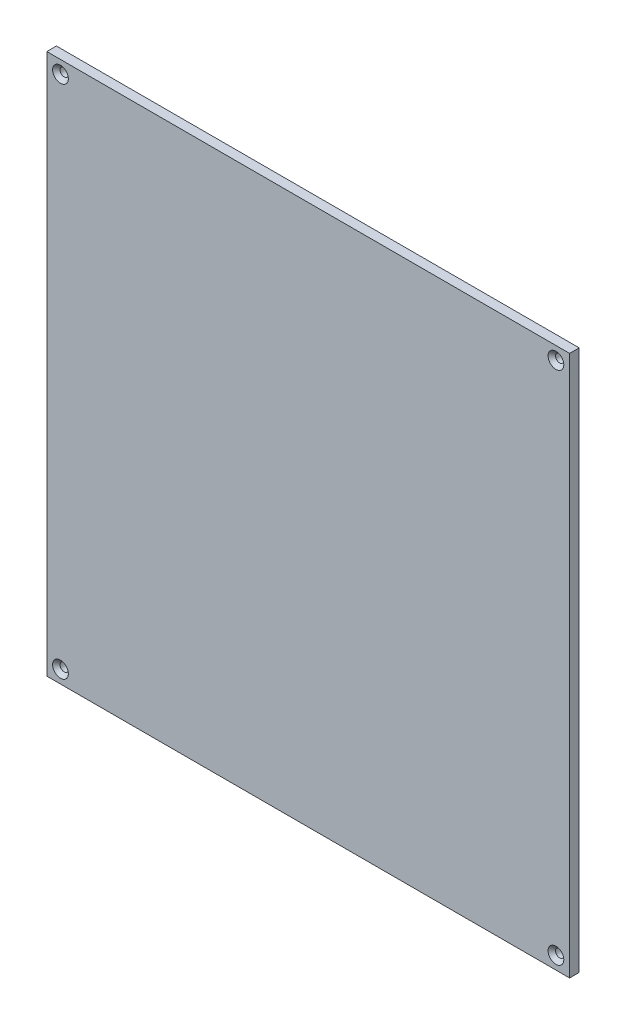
ISO-10303-21;
HEADER;
FILE_DESCRIPTION(('STEP AP214'),'2;1');
FILE_NAME('part.step','',(''),(''),'','','');
FILE_SCHEMA(('AUTOMOTIVE_DESIGN { 1 0 10303 214 1 1 1 1 }'));
ENDSEC;
DATA;
#1=APPLICATION_CONTEXT('core data for automotive mechanical design processes');
#2=APPLICATION_PROTOCOL_DEFINITION('international standard','automotive_design',2000,#1);
#3=PRODUCT_CONTEXT('',#1,'mechanical');
#4=PRODUCT('Part','Part','',(#3));
#5=PRODUCT_RELATED_PRODUCT_CATEGORY('part','',(#4));
#6=PRODUCT_DEFINITION_FORMATION('','',#4);
#7=PRODUCT_DEFINITION_CONTEXT('part definition',#1,'design');
#8=PRODUCT_DEFINITION('design','',#6,#7);
#9=PRODUCT_DEFINITION_SHAPE('','',#8);
#10=(LENGTH_UNIT() NAMED_UNIT(*) SI_UNIT(.MILLI.,.METRE.));
#11=(NAMED_UNIT(*) PLANE_ANGLE_UNIT() SI_UNIT($,.RADIAN.));
#12=(NAMED_UNIT(*) SI_UNIT($,.STERADIAN.) SOLID_ANGLE_UNIT());
#13=UNCERTAINTY_MEASURE_WITH_UNIT(LENGTH_MEASURE(1.E-05),#10,'distance_accuracy_value','');
#14=(GEOMETRIC_REPRESENTATION_CONTEXT(3) GLOBAL_UNCERTAINTY_ASSIGNED_CONTEXT((#13)) GLOBAL_UNIT_ASSIGNED_CONTEXT((#10,
#11,#12)) REPRESENTATION_CONTEXT('',''));
#15=CARTESIAN_POINT('',(0.,0.,0.));
#16=DIRECTION('',(0.,0.,1.));
#17=DIRECTION('',(1.,0.,0.));
#18=AXIS2_PLACEMENT_3D('',#15,#16,#17);
#19=CARTESIAN_POINT('',(173.,0.,6.35));
#20=DIRECTION('',(1.,0.,0.));
#21=DIRECTION('',(0.,0.,-1.));
#22=AXIS2_PLACEMENT_3D('',#19,#20,#21);
#23=PLANE('',#22);
#24=DIRECTION('',(0.,-1.,0.));
#25=VECTOR('',#24,1.);
#26=CARTESIAN_POINT('',(173.,0.,0.));
#27=LINE('',#26,#25);
#28=CARTESIAN_POINT('',(173.,179.,0.));
#29=VERTEX_POINT('',#28);
#30=CARTESIAN_POINT('',(173.,-179.,0.));
#31=VERTEX_POINT('',#30);
#32=EDGE_CURVE('E101',#29,#31,#27,.T.);
#33=ORIENTED_EDGE('',*,*,#32,.F.);
#34=DIRECTION('',(0.,0.,-1.));
#35=VECTOR('',#34,1.);
#36=CARTESIAN_POINT('',(173.,179.,6.35));
#37=LINE('',#36,#35);
#38=CARTESIAN_POINT('',(173.,179.,6.35));
#39=VERTEX_POINT('',#38);
#40=EDGE_CURVE('E11',#39,#29,#37,.T.);
#41=ORIENTED_EDGE('',*,*,#40,.F.);
#42=DIRECTION('',(0.,-1.,0.));
#43=VECTOR('',#42,1.);
#44=CARTESIAN_POINT('',(173.,0.,6.35));
#45=LINE('',#44,#43);
#46=CARTESIAN_POINT('',(173.,-179.,6.35));
#47=VERTEX_POINT('',#46);
#48=EDGE_CURVE('E94',#39,#47,#45,.T.);
#49=ORIENTED_EDGE('',*,*,#48,.T.);
#50=DIRECTION('',(0.,0.,-1.));
#51=VECTOR('',#50,1.);
#52=CARTESIAN_POINT('',(173.,-179.,6.35));
#53=LINE('',#52,#51);
#54=EDGE_CURVE('E76',#47,#31,#53,.T.);
#55=ORIENTED_EDGE('',*,*,#54,.T.);
#56=EDGE_LOOP('',(#33,#41,#49,#55));
#57=FACE_BOUND('',#56,.T.);
#58=ADVANCED_FACE('F38',(#57),#23,.T.);
#59=CARTESIAN_POINT('',(0.,179.,6.35));
#60=DIRECTION('',(0.,1.,0.));
#61=DIRECTION('',(0.,0.,1.));
#62=AXIS2_PLACEMENT_3D('',#59,#60,#61);
#63=PLANE('',#62);
#64=DIRECTION('',(1.,0.,0.));
#65=VECTOR('',#64,1.);
#66=CARTESIAN_POINT('',(0.,179.,0.));
#67=LINE('',#66,#65);
#68=CARTESIAN_POINT('',(-173.,179.,0.));
#69=VERTEX_POINT('',#68);
#70=EDGE_CURVE('E87',#69,#29,#67,.T.);
#71=ORIENTED_EDGE('',*,*,#70,.F.);
#72=DIRECTION('',(0.,0.,-1.));
#73=VECTOR('',#72,1.);
#74=CARTESIAN_POINT('',(-173.,179.,6.35));
#75=LINE('',#74,#73);
#76=CARTESIAN_POINT('',(-173.,179.,6.35));
#77=VERTEX_POINT('',#76);
#78=EDGE_CURVE('E46',#77,#69,#75,.T.);
#79=ORIENTED_EDGE('',*,*,#78,.F.);
#80=DIRECTION('',(1.,0.,0.));
#81=VECTOR('',#80,1.);
#82=CARTESIAN_POINT('',(0.,179.,6.35));
#83=LINE('',#82,#81);
#84=EDGE_CURVE('E85',#77,#39,#83,.T.);
#85=ORIENTED_EDGE('',*,*,#84,.T.);
#86=ORIENTED_EDGE('',*,*,#40,.T.);
#87=EDGE_LOOP('',(#71,#79,#85,#86));
#88=FACE_BOUND('',#87,.T.);
#89=ADVANCED_FACE('F84',(#88),#63,.T.);
#90=CARTESIAN_POINT('',(-173.,0.,6.35));
#91=DIRECTION('',(-1.,0.,0.));
#92=DIRECTION('',(0.,0.,1.));
#93=AXIS2_PLACEMENT_3D('',#90,#91,#92);
#94=PLANE('',#93);
#95=DIRECTION('',(0.,1.,0.));
#96=VECTOR('',#95,1.);
#97=CARTESIAN_POINT('',(-173.,0.,0.));
#98=LINE('',#97,#96);
#99=CARTESIAN_POINT('',(-173.,-179.,0.));
#100=VERTEX_POINT('',#99);
#101=EDGE_CURVE('E106',#100,#69,#98,.T.);
#102=ORIENTED_EDGE('',*,*,#101,.F.);
#103=DIRECTION('',(0.,0.,-1.));
#104=VECTOR('',#103,1.);
#105=CARTESIAN_POINT('',(-173.,-179.,6.35));
#106=LINE('',#105,#104);
#107=CARTESIAN_POINT('',(-173.,-179.,6.35));
#108=VERTEX_POINT('',#107);
#109=EDGE_CURVE('E69',#108,#100,#106,.T.);
#110=ORIENTED_EDGE('',*,*,#109,.F.);
#111=DIRECTION('',(0.,1.,0.));
#112=VECTOR('',#111,1.);
#113=CARTESIAN_POINT('',(-173.,0.,6.35));
#114=LINE('',#113,#112);
#115=EDGE_CURVE('E93',#108,#77,#114,.T.);
#116=ORIENTED_EDGE('',*,*,#115,.T.);
#117=ORIENTED_EDGE('',*,*,#78,.T.);
#118=EDGE_LOOP('',(#102,#110,#116,#117));
#119=FACE_BOUND('',#118,.T.);
#120=ADVANCED_FACE('F96',(#119),#94,.T.);
#121=CARTESIAN_POINT('',(0.,-179.,6.35));
#122=DIRECTION('',(0.,1.,0.));
#123=DIRECTION('',(0.,0.,1.));
#124=AXIS2_PLACEMENT_3D('',#121,#122,#123);
#125=PLANE('',#124);
#126=DIRECTION('',(1.,0.,0.));
#127=VECTOR('',#126,1.);
#128=CARTESIAN_POINT('',(0.,-179.,0.));
#129=LINE('',#128,#127);
#130=EDGE_CURVE('E108',#100,#31,#129,.T.);
#131=ORIENTED_EDGE('',*,*,#130,.T.);
#132=ORIENTED_EDGE('',*,*,#54,.F.);
#133=DIRECTION('',(1.,0.,0.));
#134=VECTOR('',#133,1.);
#135=CARTESIAN_POINT('',(0.,-179.,6.35));
#136=LINE('',#135,#134);
#137=EDGE_CURVE('E54',#108,#47,#136,.T.);
#138=ORIENTED_EDGE('',*,*,#137,.F.);
#139=ORIENTED_EDGE('',*,*,#109,.T.);
#140=EDGE_LOOP('',(#131,#132,#138,#139));
#141=FACE_BOUND('',#140,.T.);
#142=ADVANCED_FACE('F153',(#141),#125,.F.);
#143=CARTESIAN_POINT('',(0.,0.,6.35));
#144=DIRECTION('',(0.,0.,1.));
#145=DIRECTION('',(1.,0.,0.));
#146=AXIS2_PLACEMENT_3D('',#143,#144,#145);
#147=PLANE('',#146);
#148=CARTESIAN_POINT('',(-163.95,170.5,6.35));
#149=DIRECTION('',(0.,0.,1.));
#150=DIRECTION('',(1.,0.,0.));
#151=AXIS2_PLACEMENT_3D('',#148,#149,#150);
#152=CIRCLE('',#151,5.20000000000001);
#153=CARTESIAN_POINT('',(-158.75,170.5,6.35));
#154=VERTEX_POINT('',#153);
#155=EDGE_CURVE('E144',#154,#154,#152,.T.);
#156=ORIENTED_EDGE('',*,*,#155,.F.);
#157=EDGE_LOOP('',(#156));
#158=FACE_BOUND('',#157,.T.);
#159=CARTESIAN_POINT('',(163.95,170.5,6.35));
#160=DIRECTION('',(0.,0.,1.));
#161=DIRECTION('',(1.,0.,0.));
#162=AXIS2_PLACEMENT_3D('',#159,#160,#161);
#163=CIRCLE('',#162,5.20000000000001);
#164=CARTESIAN_POINT('',(169.15,170.5,6.35));
#165=VERTEX_POINT('',#164);
#166=EDGE_CURVE('E135',#165,#165,#163,.T.);
#167=ORIENTED_EDGE('',*,*,#166,.F.);
#168=EDGE_LOOP('',(#167));
#169=FACE_BOUND('',#168,.T.);
#170=CARTESIAN_POINT('',(163.95,-170.5,6.35));
#171=DIRECTION('',(0.,0.,1.));
#172=DIRECTION('',(1.,0.,0.));
#173=AXIS2_PLACEMENT_3D('',#170,#171,#172);
#174=CIRCLE('',#173,5.20000000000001);
#175=CARTESIAN_POINT('',(169.15,-170.5,6.35));
#176=VERTEX_POINT('',#175);
#177=EDGE_CURVE('E126',#176,#176,#174,.T.);
#178=ORIENTED_EDGE('',*,*,#177,.F.);
#179=EDGE_LOOP('',(#178));
#180=FACE_BOUND('',#179,.T.);
#181=CARTESIAN_POINT('',(-163.95,-170.5,6.35));
#182=DIRECTION('',(0.,0.,1.));
#183=DIRECTION('',(1.,0.,0.));
#184=AXIS2_PLACEMENT_3D('',#181,#182,#183);
#185=CIRCLE('',#184,5.20000000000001);
#186=CARTESIAN_POINT('',(-158.75,-170.5,6.35));
#187=VERTEX_POINT('',#186);
#188=EDGE_CURVE('E117',#187,#187,#185,.T.);
#189=ORIENTED_EDGE('',*,*,#188,.F.);
#190=EDGE_LOOP('',(#189));
#191=FACE_BOUND('',#190,.T.);
#192=ORIENTED_EDGE('',*,*,#48,.F.);
#193=ORIENTED_EDGE('',*,*,#84,.F.);
#194=ORIENTED_EDGE('',*,*,#115,.F.);
#195=ORIENTED_EDGE('',*,*,#137,.T.);
#196=EDGE_LOOP('',(#192,#193,#194,#195));
#197=FACE_BOUND('',#196,.T.);
#198=ADVANCED_FACE('F92',(#158,#169,#180,#191,#197),#147,.T.);
#199=CARTESIAN_POINT('',(0.,0.,0.));
#200=DIRECTION('',(0.,0.,1.));
#201=DIRECTION('',(1.,0.,0.));
#202=AXIS2_PLACEMENT_3D('',#199,#200,#201);
#203=PLANE('',#202);
#204=CARTESIAN_POINT('',(-163.95,170.5,0.));
#205=DIRECTION('',(0.,0.,1.));
#206=DIRECTION('',(1.,0.,0.));
#207=AXIS2_PLACEMENT_3D('',#204,#205,#206);
#208=CIRCLE('',#207,2.74999999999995);
#209=CARTESIAN_POINT('',(-161.2,170.5,0.));
#210=VERTEX_POINT('',#209);
#211=EDGE_CURVE('E138',#210,#210,#208,.T.);
#212=ORIENTED_EDGE('',*,*,#211,.T.);
#213=EDGE_LOOP('',(#212));
#214=FACE_BOUND('',#213,.T.);
#215=CARTESIAN_POINT('',(163.95,170.5,0.));
#216=DIRECTION('',(0.,0.,1.));
#217=DIRECTION('',(1.,0.,0.));
#218=AXIS2_PLACEMENT_3D('',#215,#216,#217);
#219=CIRCLE('',#218,2.74999999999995);
#220=CARTESIAN_POINT('',(166.7,170.5,0.));
#221=VERTEX_POINT('',#220);
#222=EDGE_CURVE('E129',#221,#221,#219,.T.);
#223=ORIENTED_EDGE('',*,*,#222,.T.);
#224=EDGE_LOOP('',(#223));
#225=FACE_BOUND('',#224,.T.);
#226=CARTESIAN_POINT('',(163.95,-170.5,0.));
#227=DIRECTION('',(0.,0.,1.));
#228=DIRECTION('',(1.,0.,0.));
#229=AXIS2_PLACEMENT_3D('',#226,#227,#228);
#230=CIRCLE('',#229,2.74999999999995);
#231=CARTESIAN_POINT('',(166.7,-170.5,0.));
#232=VERTEX_POINT('',#231);
#233=EDGE_CURVE('E120',#232,#232,#230,.T.);
#234=ORIENTED_EDGE('',*,*,#233,.T.);
#235=EDGE_LOOP('',(#234));
#236=FACE_BOUND('',#235,.T.);
#237=CARTESIAN_POINT('',(-163.95,-170.5,0.));
#238=DIRECTION('',(0.,0.,1.));
#239=DIRECTION('',(1.,0.,0.));
#240=AXIS2_PLACEMENT_3D('',#237,#238,#239);
#241=CIRCLE('',#240,2.74999999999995);
#242=CARTESIAN_POINT('',(-161.2,-170.5,0.));
#243=VERTEX_POINT('',#242);
#244=EDGE_CURVE('E104',#243,#243,#241,.T.);
#245=ORIENTED_EDGE('',*,*,#244,.T.);
#246=EDGE_LOOP('',(#245));
#247=FACE_BOUND('',#246,.T.);
#248=ORIENTED_EDGE('',*,*,#32,.T.);
#249=ORIENTED_EDGE('',*,*,#130,.F.);
#250=ORIENTED_EDGE('',*,*,#101,.T.);
#251=ORIENTED_EDGE('',*,*,#70,.T.);
#252=EDGE_LOOP('',(#248,#249,#250,#251));
#253=FACE_BOUND('',#252,.T.);
#254=ADVANCED_FACE('F152',(#214,#225,#236,#247,#253),#203,.F.);
#255=CARTESIAN_POINT('',(-163.95,-170.5,6.35));
#256=DIRECTION('',(0.,0.,1.));
#257=DIRECTION('',(1.,0.,0.));
#258=AXIS2_PLACEMENT_3D('',#255,#256,#257);
#259=CYLINDRICAL_SURFACE('',#258,2.74999999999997);
#260=ORIENTED_EDGE('',*,*,#244,.F.);
#261=EDGE_LOOP('',(#260));
#262=FACE_BOUND('',#261,.T.);
#263=CARTESIAN_POINT('',(-163.95,-170.5,3.9));
#264=DIRECTION('',(0.,0.,1.));
#265=DIRECTION('',(1.,0.,0.));
#266=AXIS2_PLACEMENT_3D('',#263,#264,#265);
#267=CIRCLE('',#266,2.75);
#268=CARTESIAN_POINT('',(-161.2,-170.5,3.9));
#269=VERTEX_POINT('',#268);
#270=EDGE_CURVE('E114',#269,#269,#267,.T.);
#271=ORIENTED_EDGE('',*,*,#270,.T.);
#272=EDGE_LOOP('',(#271));
#273=FACE_BOUND('',#272,.T.);
#274=ADVANCED_FACE('F164',(#262,#273),#259,.F.);
#275=CARTESIAN_POINT('',(-163.95,-170.5,6.35));
#276=DIRECTION('',(0.,0.,1.));
#277=DIRECTION('',(1.,0.,0.));
#278=AXIS2_PLACEMENT_3D('',#275,#276,#277);
#279=CONICAL_SURFACE('',#278,5.20000000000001,0.78539816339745);
#280=ORIENTED_EDGE('',*,*,#270,.F.);
#281=EDGE_LOOP('',(#280));
#282=FACE_BOUND('',#281,.T.);
#283=ORIENTED_EDGE('',*,*,#188,.T.);
#284=EDGE_LOOP('',(#283));
#285=FACE_BOUND('',#284,.T.);
#286=ADVANCED_FACE('F161',(#282,#285),#279,.F.);
#287=CARTESIAN_POINT('',(163.95,-170.5,6.35));
#288=DIRECTION('',(0.,0.,1.));
#289=DIRECTION('',(1.,0.,0.));
#290=AXIS2_PLACEMENT_3D('',#287,#288,#289);
#291=CYLINDRICAL_SURFACE('',#290,2.74999999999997);
#292=ORIENTED_EDGE('',*,*,#233,.F.);
#293=EDGE_LOOP('',(#292));
#294=FACE_BOUND('',#293,.T.);
#295=CARTESIAN_POINT('',(163.95,-170.5,3.9));
#296=DIRECTION('',(0.,0.,1.));
#297=DIRECTION('',(1.,0.,0.));
#298=AXIS2_PLACEMENT_3D('',#295,#296,#297);
#299=CIRCLE('',#298,2.75);
#300=CARTESIAN_POINT('',(166.7,-170.5,3.9));
#301=VERTEX_POINT('',#300);
#302=EDGE_CURVE('E123',#301,#301,#299,.T.);
#303=ORIENTED_EDGE('',*,*,#302,.T.);
#304=EDGE_LOOP('',(#303));
#305=FACE_BOUND('',#304,.T.);
#306=ADVANCED_FACE('F163',(#294,#305),#291,.F.);
#307=CARTESIAN_POINT('',(163.95,-170.5,6.35));
#308=DIRECTION('',(0.,0.,1.));
#309=DIRECTION('',(1.,0.,0.));
#310=AXIS2_PLACEMENT_3D('',#307,#308,#309);
#311=CONICAL_SURFACE('',#310,5.20000000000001,0.78539816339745);
#312=ORIENTED_EDGE('',*,*,#302,.F.);
#313=EDGE_LOOP('',(#312));
#314=FACE_BOUND('',#313,.T.);
#315=ORIENTED_EDGE('',*,*,#177,.T.);
#316=EDGE_LOOP('',(#315));
#317=FACE_BOUND('',#316,.T.);
#318=ADVANCED_FACE('F171',(#314,#317),#311,.F.);
#319=CARTESIAN_POINT('',(163.95,170.5,6.35));
#320=DIRECTION('',(0.,0.,1.));
#321=DIRECTION('',(1.,0.,0.));
#322=AXIS2_PLACEMENT_3D('',#319,#320,#321);
#323=CYLINDRICAL_SURFACE('',#322,2.74999999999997);
#324=ORIENTED_EDGE('',*,*,#222,.F.);
#325=EDGE_LOOP('',(#324));
#326=FACE_BOUND('',#325,.T.);
#327=CARTESIAN_POINT('',(163.95,170.5,3.9));
#328=DIRECTION('',(0.,0.,1.));
#329=DIRECTION('',(1.,0.,0.));
#330=AXIS2_PLACEMENT_3D('',#327,#328,#329);
#331=CIRCLE('',#330,2.75);
#332=CARTESIAN_POINT('',(166.7,170.5,3.9));
#333=VERTEX_POINT('',#332);
#334=EDGE_CURVE('E132',#333,#333,#331,.T.);
#335=ORIENTED_EDGE('',*,*,#334,.T.);
#336=EDGE_LOOP('',(#335));
#337=FACE_BOUND('',#336,.T.);
#338=ADVANCED_FACE('F233',(#326,#337),#323,.F.);
#339=CARTESIAN_POINT('',(163.95,170.5,6.35));
#340=DIRECTION('',(0.,0.,1.));
#341=DIRECTION('',(1.,0.,0.));
#342=AXIS2_PLACEMENT_3D('',#339,#340,#341);
#343=CONICAL_SURFACE('',#342,5.20000000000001,0.78539816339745);
#344=ORIENTED_EDGE('',*,*,#334,.F.);
#345=EDGE_LOOP('',(#344));
#346=FACE_BOUND('',#345,.T.);
#347=ORIENTED_EDGE('',*,*,#166,.T.);
#348=EDGE_LOOP('',(#347));
#349=FACE_BOUND('',#348,.T.);
#350=ADVANCED_FACE('F243',(#346,#349),#343,.F.);
#351=CARTESIAN_POINT('',(-163.95,170.5,6.35));
#352=DIRECTION('',(0.,0.,1.));
#353=DIRECTION('',(1.,0.,0.));
#354=AXIS2_PLACEMENT_3D('',#351,#352,#353);
#355=CYLINDRICAL_SURFACE('',#354,2.74999999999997);
#356=ORIENTED_EDGE('',*,*,#211,.F.);
#357=EDGE_LOOP('',(#356));
#358=FACE_BOUND('',#357,.T.);
#359=CARTESIAN_POINT('',(-163.95,170.5,3.9));
#360=DIRECTION('',(0.,0.,1.));
#361=DIRECTION('',(1.,0.,0.));
#362=AXIS2_PLACEMENT_3D('',#359,#360,#361);
#363=CIRCLE('',#362,2.75);
#364=CARTESIAN_POINT('',(-161.2,170.5,3.9));
#365=VERTEX_POINT('',#364);
#366=EDGE_CURVE('E141',#365,#365,#363,.T.);
#367=ORIENTED_EDGE('',*,*,#366,.T.);
#368=EDGE_LOOP('',(#367));
#369=FACE_BOUND('',#368,.T.);
#370=ADVANCED_FACE('F253',(#358,#369),#355,.F.);
#371=CARTESIAN_POINT('',(-163.95,170.5,6.35));
#372=DIRECTION('',(0.,0.,1.));
#373=DIRECTION('',(1.,0.,0.));
#374=AXIS2_PLACEMENT_3D('',#371,#372,#373);
#375=CONICAL_SURFACE('',#374,5.20000000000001,0.78539816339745);
#376=ORIENTED_EDGE('',*,*,#366,.F.);
#377=EDGE_LOOP('',(#376));
#378=FACE_BOUND('',#377,.T.);
#379=ORIENTED_EDGE('',*,*,#155,.T.);
#380=EDGE_LOOP('',(#379));
#381=FACE_BOUND('',#380,.T.);
#382=ADVANCED_FACE('F148',(#378,#381),#375,.F.);
#383=CLOSED_SHELL('',(#58,#89,#120,#142,#198,#254,#274,#286,#306,#318,#338,#350,#370,#382));
#384=MANIFOLD_SOLID_BREP('B2',#383);
#385=ADVANCED_BREP_SHAPE_REPRESENTATION('',(#18,#384),#14);
#386=SHAPE_DEFINITION_REPRESENTATION(#9,#385);
ENDSEC;
END-ISO-10303-21;
